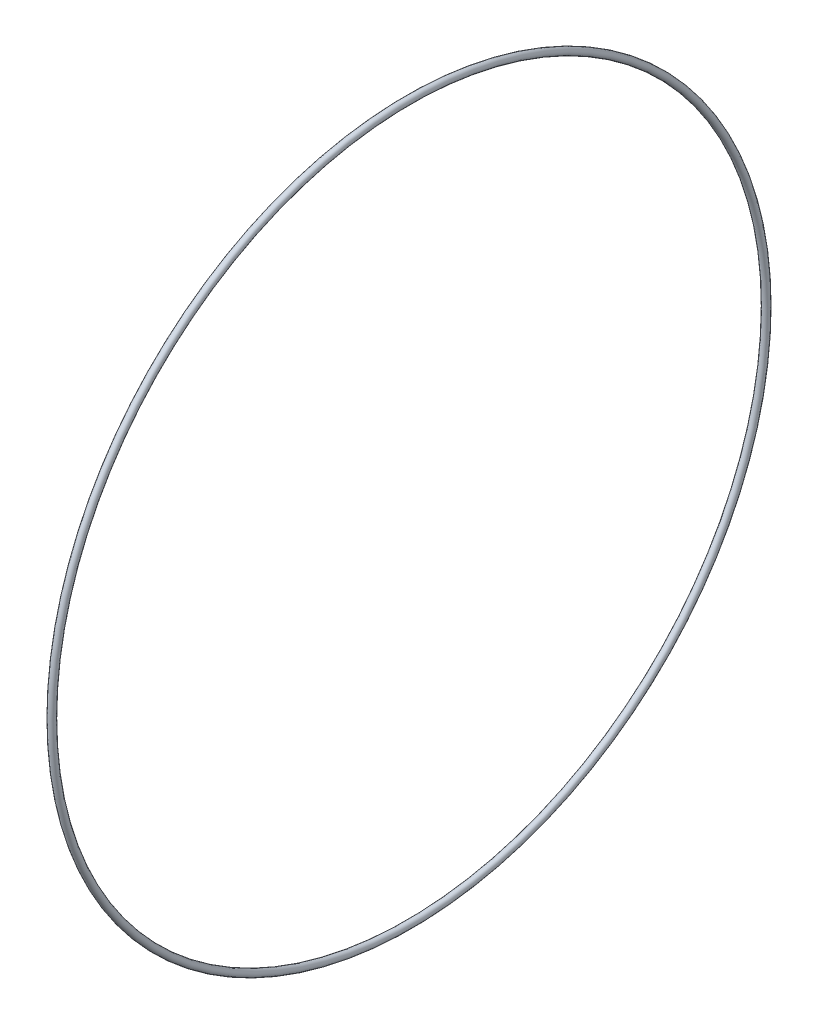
ISO-10303-21;
HEADER;
FILE_DESCRIPTION(('STEP AP214'),'2;1');
FILE_NAME('part.step','',(''),(''),'','','');
FILE_SCHEMA(('AUTOMOTIVE_DESIGN { 1 0 10303 214 1 1 1 1 }'));
ENDSEC;
DATA;
#1=APPLICATION_CONTEXT('core data for automotive mechanical design processes');
#2=APPLICATION_PROTOCOL_DEFINITION('international standard','automotive_design',2000,#1);
#3=PRODUCT_CONTEXT('',#1,'mechanical');
#4=PRODUCT('Part','Part','',(#3));
#5=PRODUCT_RELATED_PRODUCT_CATEGORY('part','',(#4));
#6=PRODUCT_DEFINITION_FORMATION('','',#4);
#7=PRODUCT_DEFINITION_CONTEXT('part definition',#1,'design');
#8=PRODUCT_DEFINITION('design','',#6,#7);
#9=PRODUCT_DEFINITION_SHAPE('','',#8);
#10=(LENGTH_UNIT() NAMED_UNIT(*) SI_UNIT(.MILLI.,.METRE.));
#11=(NAMED_UNIT(*) PLANE_ANGLE_UNIT() SI_UNIT($,.RADIAN.));
#12=(NAMED_UNIT(*) SI_UNIT($,.STERADIAN.) SOLID_ANGLE_UNIT());
#13=UNCERTAINTY_MEASURE_WITH_UNIT(LENGTH_MEASURE(1.E-05),#10,'distance_accuracy_value','');
#14=(GEOMETRIC_REPRESENTATION_CONTEXT(3) GLOBAL_UNCERTAINTY_ASSIGNED_CONTEXT((#13)) GLOBAL_UNIT_ASSIGNED_CONTEXT((#10,
#11,#12)) REPRESENTATION_CONTEXT('',''));
#15=CARTESIAN_POINT('',(0.,0.,0.));
#16=DIRECTION('',(0.,0.,1.));
#17=DIRECTION('',(1.,0.,0.));
#18=AXIS2_PLACEMENT_3D('',#15,#16,#17);
#19=CARTESIAN_POINT('',(8.5,0.,0.));
#20=DIRECTION('',(-1.,0.,0.));
#21=DIRECTION('',(0.,0.,1.));
#22=AXIS2_PLACEMENT_3D('',#19,#20,#21);
#23=TOROIDAL_SURFACE('',#22,51.5,0.500000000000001);
#24=CARTESIAN_POINT('',(8.5,0.,52.));
#25=VERTEX_POINT('',#24);
#26=VERTEX_LOOP('',#25);
#27=FACE_BOUND('',#26,.T.);
#28=ADVANCED_FACE('F364',(#27),#23,.T.);
#29=CLOSED_SHELL('',(#28));
#30=MANIFOLD_SOLID_BREP('B2',#29);
#31=ADVANCED_BREP_SHAPE_REPRESENTATION('',(#18,#30),#14);
#32=SHAPE_DEFINITION_REPRESENTATION(#9,#31);
ENDSEC;
END-ISO-10303-21;
